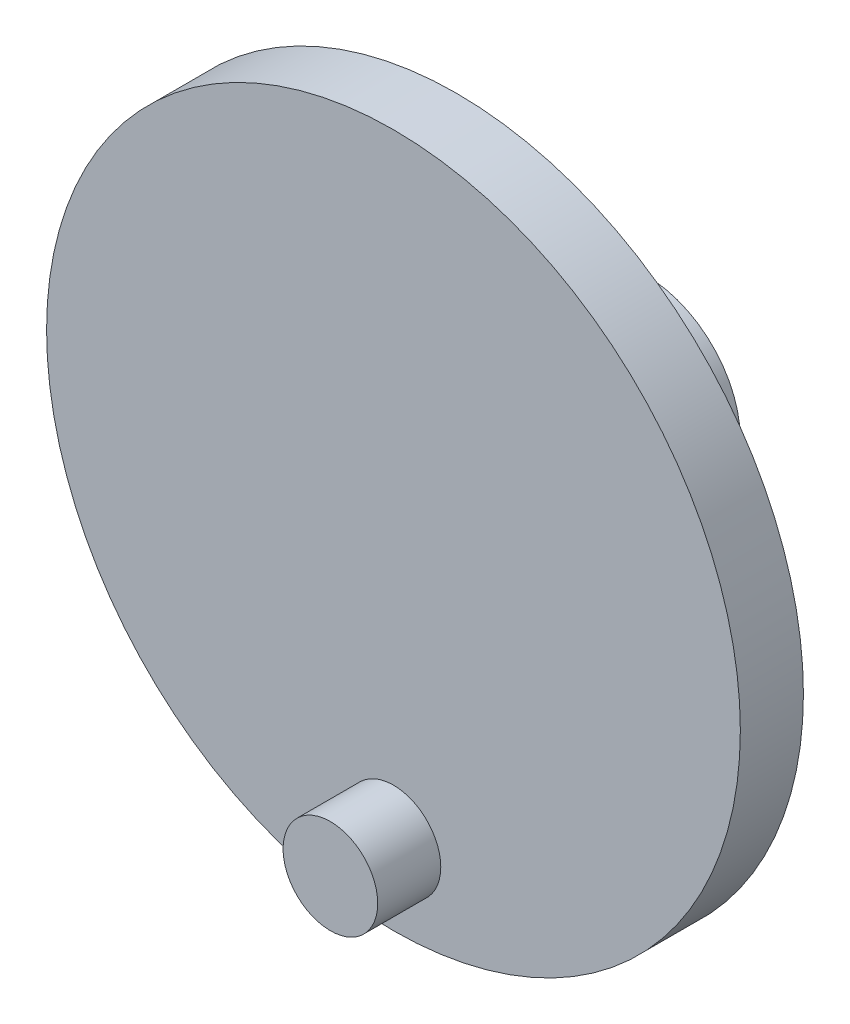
ISO-10303-21;
HEADER;
FILE_DESCRIPTION(('STEP AP214'),'2;1');
FILE_NAME('part.step','',(''),(''),'','','');
FILE_SCHEMA(('AUTOMOTIVE_DESIGN { 1 0 10303 214 1 1 1 1 }'));
ENDSEC;
DATA;
#1=APPLICATION_CONTEXT('core data for automotive mechanical design processes');
#2=APPLICATION_PROTOCOL_DEFINITION('international standard','automotive_design',2000,#1);
#3=PRODUCT_CONTEXT('',#1,'mechanical');
#4=PRODUCT('Part','Part','',(#3));
#5=PRODUCT_RELATED_PRODUCT_CATEGORY('part','',(#4));
#6=PRODUCT_DEFINITION_FORMATION('','',#4);
#7=PRODUCT_DEFINITION_CONTEXT('part definition',#1,'design');
#8=PRODUCT_DEFINITION('design','',#6,#7);
#9=PRODUCT_DEFINITION_SHAPE('','',#8);
#10=(LENGTH_UNIT() NAMED_UNIT(*) SI_UNIT(.MILLI.,.METRE.));
#11=(NAMED_UNIT(*) PLANE_ANGLE_UNIT() SI_UNIT($,.RADIAN.));
#12=(NAMED_UNIT(*) SI_UNIT($,.STERADIAN.) SOLID_ANGLE_UNIT());
#13=UNCERTAINTY_MEASURE_WITH_UNIT(LENGTH_MEASURE(1.E-05),#10,'distance_accuracy_value','');
#14=(GEOMETRIC_REPRESENTATION_CONTEXT(3) GLOBAL_UNCERTAINTY_ASSIGNED_CONTEXT((#13)) GLOBAL_UNIT_ASSIGNED_CONTEXT((#10,
#11,#12)) REPRESENTATION_CONTEXT('',''));
#15=CARTESIAN_POINT('',(0.,0.,0.));
#16=DIRECTION('',(0.,0.,1.));
#17=DIRECTION('',(1.,0.,0.));
#18=AXIS2_PLACEMENT_3D('',#15,#16,#17);
#19=CARTESIAN_POINT('',(0.,0.,-10.));
#20=DIRECTION('',(0.,0.,1.));
#21=DIRECTION('',(1.,0.,0.));
#22=AXIS2_PLACEMENT_3D('',#19,#20,#21);
#23=CYLINDRICAL_SURFACE('',#22,55.);
#24=CARTESIAN_POINT('',(0.,0.,-10.));
#25=DIRECTION('',(0.,0.,1.));
#26=DIRECTION('',(1.,0.,0.));
#27=AXIS2_PLACEMENT_3D('',#24,#25,#26);
#28=CIRCLE('',#27,55.);
#29=CARTESIAN_POINT('',(55.,0.,-10.));
#30=VERTEX_POINT('',#29);
#31=EDGE_CURVE('E11',#30,#30,#28,.T.);
#32=ORIENTED_EDGE('',*,*,#31,.T.);
#33=EDGE_LOOP('',(#32));
#34=FACE_BOUND('',#33,.T.);
#35=CARTESIAN_POINT('',(0.,0.,0.));
#36=DIRECTION('',(0.,0.,1.));
#37=DIRECTION('',(1.,0.,0.));
#38=AXIS2_PLACEMENT_3D('',#35,#36,#37);
#39=CIRCLE('',#38,55.);
#40=CARTESIAN_POINT('',(55.,0.,0.));
#41=VERTEX_POINT('',#40);
#42=EDGE_CURVE('E38',#41,#41,#39,.T.);
#43=ORIENTED_EDGE('',*,*,#42,.F.);
#44=EDGE_LOOP('',(#43));
#45=FACE_BOUND('',#44,.T.);
#46=ADVANCED_FACE('F35',(#34,#45),#23,.T.);
#47=CARTESIAN_POINT('',(0.,0.,-10.));
#48=DIRECTION('',(0.,0.,1.));
#49=DIRECTION('',(1.,0.,0.));
#50=AXIS2_PLACEMENT_3D('',#47,#48,#49);
#51=PLANE('',#50);
#52=CARTESIAN_POINT('',(0.,0.,-9.99999999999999));
#53=DIRECTION('',(0.,0.,1.));
#54=DIRECTION('',(1.,0.,0.));
#55=AXIS2_PLACEMENT_3D('',#52,#53,#54);
#56=CIRCLE('',#55,15.);
#57=CARTESIAN_POINT('',(15.,0.,-9.99999999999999));
#58=VERTEX_POINT('',#57);
#59=EDGE_CURVE('E50',#58,#58,#56,.T.);
#60=ORIENTED_EDGE('',*,*,#59,.T.);
#61=EDGE_LOOP('',(#60));
#62=FACE_BOUND('',#61,.T.);
#63=ORIENTED_EDGE('',*,*,#31,.F.);
#64=EDGE_LOOP('',(#63));
#65=FACE_BOUND('',#64,.T.);
#66=ADVANCED_FACE('F68',(#62,#65),#51,.F.);
#67=CARTESIAN_POINT('',(0.,0.,0.));
#68=DIRECTION('',(0.,0.,1.));
#69=DIRECTION('',(1.,0.,0.));
#70=AXIS2_PLACEMENT_3D('',#67,#68,#69);
#71=PLANE('',#70);
#72=CARTESIAN_POINT('',(0.,-42.5,0.));
#73=DIRECTION('',(0.,0.,1.));
#74=DIRECTION('',(1.,0.,0.));
#75=AXIS2_PLACEMENT_3D('',#72,#73,#74);
#76=CIRCLE('',#75,7.49999999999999);
#77=CARTESIAN_POINT('',(7.49999999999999,-42.5,0.));
#78=VERTEX_POINT('',#77);
#79=EDGE_CURVE('E47',#78,#78,#76,.T.);
#80=ORIENTED_EDGE('',*,*,#79,.F.);
#81=EDGE_LOOP('',(#80));
#82=FACE_BOUND('',#81,.T.);
#83=ORIENTED_EDGE('',*,*,#42,.T.);
#84=EDGE_LOOP('',(#83));
#85=FACE_BOUND('',#84,.T.);
#86=ADVANCED_FACE('F71',(#82,#85),#71,.T.);
#87=CARTESIAN_POINT('',(0.,-42.5,10.));
#88=DIRECTION('',(0.,0.,-1.));
#89=DIRECTION('',(-1.,0.,0.));
#90=AXIS2_PLACEMENT_3D('',#87,#88,#89);
#91=CYLINDRICAL_SURFACE('',#90,7.49999999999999);
#92=CARTESIAN_POINT('',(0.,-42.5,10.));
#93=DIRECTION('',(0.,0.,1.));
#94=DIRECTION('',(1.,0.,0.));
#95=AXIS2_PLACEMENT_3D('',#92,#93,#94);
#96=CIRCLE('',#95,7.49999999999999);
#97=CARTESIAN_POINT('',(7.49999999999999,-42.5,10.));
#98=VERTEX_POINT('',#97);
#99=EDGE_CURVE('E45',#98,#98,#96,.T.);
#100=ORIENTED_EDGE('',*,*,#99,.F.);
#101=EDGE_LOOP('',(#100));
#102=FACE_BOUND('',#101,.T.);
#103=ORIENTED_EDGE('',*,*,#79,.T.);
#104=EDGE_LOOP('',(#103));
#105=FACE_BOUND('',#104,.T.);
#106=ADVANCED_FACE('F77',(#102,#105),#91,.T.);
#107=CARTESIAN_POINT('',(0.,0.,10.));
#108=DIRECTION('',(0.,0.,1.));
#109=DIRECTION('',(1.,0.,0.));
#110=AXIS2_PLACEMENT_3D('',#107,#108,#109);
#111=PLANE('',#110);
#112=ORIENTED_EDGE('',*,*,#99,.T.);
#113=EDGE_LOOP('',(#112));
#114=FACE_BOUND('',#113,.T.);
#115=ADVANCED_FACE('F64',(#114),#111,.T.);
#116=CARTESIAN_POINT('',(0.,0.,-112.426406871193));
#117=DIRECTION('',(0.,0.,1.));
#118=DIRECTION('',(1.,0.,0.));
#119=AXIS2_PLACEMENT_3D('',#116,#117,#118);
#120=CYLINDRICAL_SURFACE('',#119,15.);
#121=CARTESIAN_POINT('',(0.,0.,-40.));
#122=DIRECTION('',(0.,0.,1.));
#123=DIRECTION('',(1.,0.,0.));
#124=AXIS2_PLACEMENT_3D('',#121,#122,#123);
#125=CIRCLE('',#124,15.);
#126=CARTESIAN_POINT('',(15.,0.,-40.));
#127=VERTEX_POINT('',#126);
#128=EDGE_CURVE('E55',#127,#127,#125,.F.);
#129=ORIENTED_EDGE('',*,*,#128,.F.);
#130=EDGE_LOOP('',(#129));
#131=FACE_BOUND('',#130,.T.);
#132=ORIENTED_EDGE('',*,*,#59,.F.);
#133=EDGE_LOOP('',(#132));
#134=FACE_BOUND('',#133,.T.);
#135=ADVANCED_FACE('F61',(#131,#134),#120,.T.);
#136=CARTESIAN_POINT('',(0.,0.,-40.));
#137=DIRECTION('',(0.,0.,1.));
#138=DIRECTION('',(1.,0.,0.));
#139=AXIS2_PLACEMENT_3D('',#136,#137,#138);
#140=PLANE('',#139);
#141=ORIENTED_EDGE('',*,*,#128,.T.);
#142=EDGE_LOOP('',(#141));
#143=FACE_BOUND('',#142,.T.);
#144=ADVANCED_FACE('F59',(#143),#140,.F.);
#145=CLOSED_SHELL('',(#46,#66,#86,#106,#115,#135,#144));
#146=MANIFOLD_SOLID_BREP('B2',#145);
#147=ADVANCED_BREP_SHAPE_REPRESENTATION('',(#18,#146),#14);
#148=SHAPE_DEFINITION_REPRESENTATION(#9,#147);
ENDSEC;
END-ISO-10303-21;
